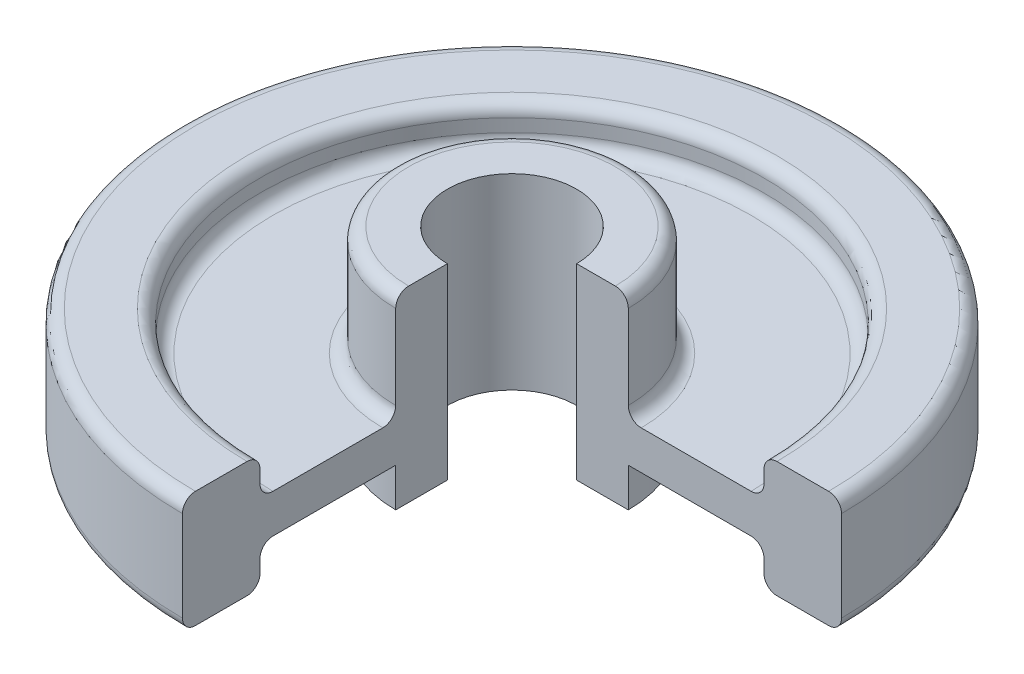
from build123d import *

# Parameters (mm, degrees)
SKETCH2_R      = 15.875
CENTER_H_DEPTH = 124.411805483
SKETCH3_W      = 33.3375
SKETCH3_H      = 9.525
SKETCH4_W      = 33.3375
SKETCH4_H      = 9.525
FILLET_R_125_R = 3.175
SKETCH5_W      = 80.9625
SKETCH5_H      = 80.9625
CUTAWAY_DEPTH  = 124.411805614


with BuildPart() as part:
    # Sketch1 → wheel (revolve)
    with BuildSketch(Plane.XY, mode=Mode.PRIVATE) as wheel_sk:
        Polygon((0, 0), (80.9625, 0), (80.9625, 28.575), (28.575, 28.575), (28.575, 46.0502), (0, 46.0502), align=None)
    revolve(wheel_sk.sketch.rotate(Axis((0, 0, 0), (0, 1, 0)), 90), axis=Axis((0, 0, 0), (0, 1, 0)))

    # Sketch2 → center_h (cut, through all)
    with BuildSketch(Plane(origin=(0, 46.0502, 0), x_dir=(-1, 0, 0), z_dir=(0, 1, 0))):
        with Locations(Location((0, 0, 0), (0, 0, 90))):
            Circle(SKETCH2_R)
    extrude(amount=-CENTER_H_DEPTH, mode=Mode.SUBTRACT)

    # Sketch3 → upper_cut (revolve, cut)
    with BuildSketch(Plane.XY, mode=Mode.PRIVATE) as upper_cut_sk:
        with Locations((45.24375, 23.8125)):
            Rectangle(SKETCH3_W, SKETCH3_H)
    revolve(upper_cut_sk.sketch.rotate(Axis((0, 0, 0), (0, 1, 0)), 90), axis=Axis((0, 0, 0), (0, 1, 0)), mode=Mode.SUBTRACT)

    # Sketch4 → lower_cut (revolve, cut)
    with BuildSketch(Plane.XY, mode=Mode.PRIVATE) as lower_cut_sk:
        with Locations((45.24375, 4.7625)):
            Rectangle(SKETCH4_W, SKETCH4_H)
    revolve(lower_cut_sk.sketch.rotate(Axis((0, 0, 0), (0, 1, 0)), 90), axis=Axis((0, 0, 0), (0, 1, 0)), mode=Mode.SUBTRACT)

    # Fillet R.125
    fillet_r_125_edges = [part.edges().sort_by_distance(p)[0] for p in [
        (0, 28.575, 61.9125),
        (0, 19.05, 61.9125),
        (0, 19.05, 28.575),
        (0, 0, 61.9125),
        (0, 9.525, 61.9125),
        (0, 46.0502, 28.575),
        (0, 28.575, 80.9625),
        (0, 0, 80.9625),
    ]]
    fillet(fillet_r_125_edges, radius=FILLET_R_125_R)

    # Sketch5 → cutaway (cut, through all)
    with BuildSketch(Plane(origin=(0, 46.0502, 0), x_dir=(-1, 0, 0), z_dir=(0, 1, 0))):
        with Locations((-40.48125, 40.48125)):
            Rectangle(SKETCH5_W, SKETCH5_H)
    extrude(amount=-CUTAWAY_DEPTH, mode=Mode.SUBTRACT)


solid = part.part
